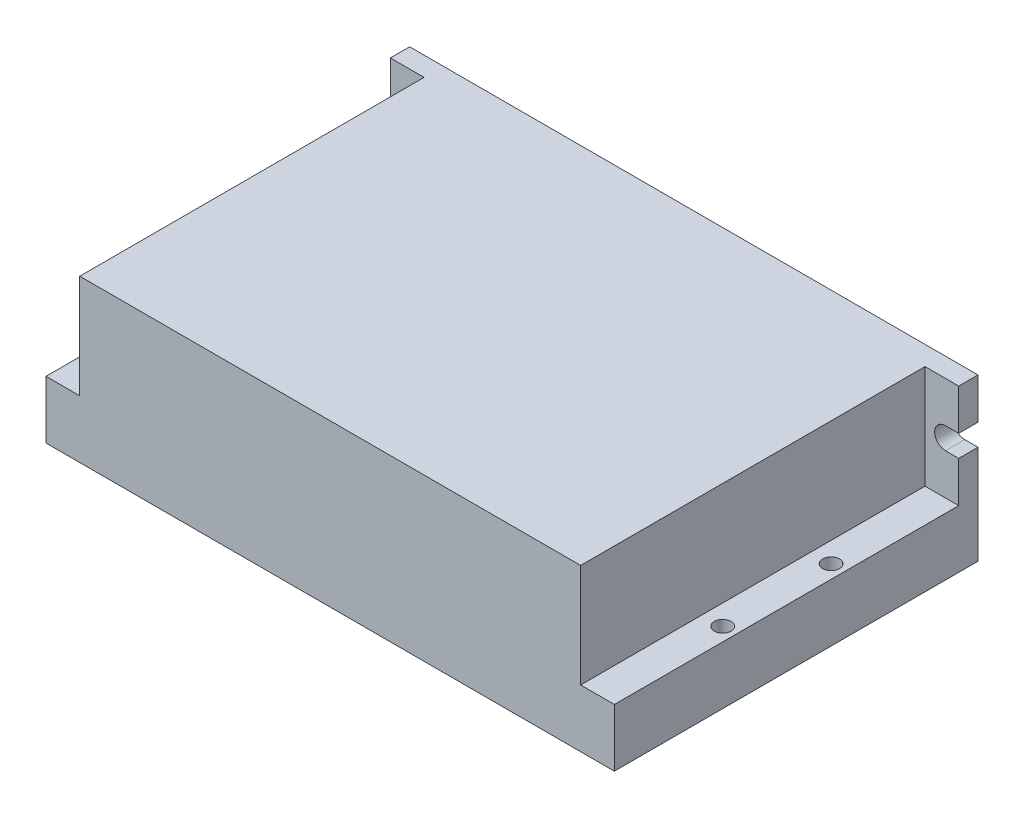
ISO-10303-21;
HEADER;
FILE_DESCRIPTION(('STEP AP214'),'2;1');
FILE_NAME('part.step','',(''),(''),'','','');
FILE_SCHEMA(('AUTOMOTIVE_DESIGN { 1 0 10303 214 1 1 1 1 }'));
ENDSEC;
DATA;
#1=APPLICATION_CONTEXT('core data for automotive mechanical design processes');
#2=APPLICATION_PROTOCOL_DEFINITION('international standard','automotive_design',2000,#1);
#3=PRODUCT_CONTEXT('',#1,'mechanical');
#4=PRODUCT('Part','Part','',(#3));
#5=PRODUCT_RELATED_PRODUCT_CATEGORY('part','',(#4));
#6=PRODUCT_DEFINITION_FORMATION('','',#4);
#7=PRODUCT_DEFINITION_CONTEXT('part definition',#1,'design');
#8=PRODUCT_DEFINITION('design','',#6,#7);
#9=PRODUCT_DEFINITION_SHAPE('','',#8);
#10=(LENGTH_UNIT() NAMED_UNIT(*) SI_UNIT(.MILLI.,.METRE.));
#11=(NAMED_UNIT(*) PLANE_ANGLE_UNIT() SI_UNIT($,.RADIAN.));
#12=(NAMED_UNIT(*) SI_UNIT($,.STERADIAN.) SOLID_ANGLE_UNIT());
#13=UNCERTAINTY_MEASURE_WITH_UNIT(LENGTH_MEASURE(1.E-05),#10,'distance_accuracy_value','');
#14=(GEOMETRIC_REPRESENTATION_CONTEXT(3) GLOBAL_UNCERTAINTY_ASSIGNED_CONTEXT((#13)) GLOBAL_UNIT_ASSIGNED_CONTEXT((#10,
#11,#12)) REPRESENTATION_CONTEXT('',''));
#15=CARTESIAN_POINT('',(0.,0.,0.));
#16=DIRECTION('',(0.,0.,1.));
#17=DIRECTION('',(1.,0.,0.));
#18=AXIS2_PLACEMENT_3D('',#15,#16,#17);
#19=CARTESIAN_POINT('',(0.,33.5,0.));
#20=DIRECTION('',(1.,0.,0.));
#21=DIRECTION('',(0.,0.,-1.));
#22=AXIS2_PLACEMENT_3D('',#19,#20,#21);
#23=PLANE('',#22);
#24=DIRECTION('',(0.,-1.,0.));
#25=VECTOR('',#24,1.);
#26=CARTESIAN_POINT('',(0.,33.5,-75.5));
#27=LINE('',#26,#25);
#28=CARTESIAN_POINT('',(0.,33.5,-75.5));
#29=VERTEX_POINT('',#28);
#30=CARTESIAN_POINT('',(0.,25.,-75.5));
#31=VERTEX_POINT('',#30);
#32=EDGE_CURVE('E182',#29,#31,#27,.T.);
#33=ORIENTED_EDGE('',*,*,#32,.T.);
#34=DIRECTION('',(0.,0.,1.));
#35=VECTOR('',#34,1.);
#36=CARTESIAN_POINT('',(0.,25.,-75.5));
#37=LINE('',#36,#35);
#38=CARTESIAN_POINT('',(0.,25.,-71.5));
#39=VERTEX_POINT('',#38);
#40=EDGE_CURVE('E287',#31,#39,#37,.T.);
#41=ORIENTED_EDGE('',*,*,#40,.T.);
#42=DIRECTION('',(0.,-1.,0.));
#43=VECTOR('',#42,1.);
#44=CARTESIAN_POINT('',(0.,33.5,-71.5));
#45=LINE('',#44,#43);
#46=CARTESIAN_POINT('',(0.,33.5,-71.5));
#47=VERTEX_POINT('',#46);
#48=EDGE_CURVE('E244',#47,#39,#45,.T.);
#49=ORIENTED_EDGE('',*,*,#48,.F.);
#50=DIRECTION('',(0.,0.,1.));
#51=VECTOR('',#50,1.);
#52=CARTESIAN_POINT('',(0.,33.5,0.));
#53=LINE('',#52,#51);
#54=EDGE_CURVE('E216',#29,#47,#53,.T.);
#55=ORIENTED_EDGE('',*,*,#54,.F.);
#56=EDGE_LOOP('',(#33,#41,#49,#55));
#57=FACE_BOUND('',#56,.T.);
#58=ADVANCED_FACE('F35',(#57),#23,.F.);
#59=CARTESIAN_POINT('',(118.,33.5,0.));
#60=DIRECTION('',(-1.,0.,0.));
#61=DIRECTION('',(0.,0.,1.));
#62=AXIS2_PLACEMENT_3D('',#59,#60,#61);
#63=PLANE('',#62);
#64=DIRECTION('',(0.,-1.,0.));
#65=VECTOR('',#64,1.);
#66=CARTESIAN_POINT('',(118.,33.5,-75.5));
#67=LINE('',#66,#65);
#68=CARTESIAN_POINT('',(118.,20.5,-75.5));
#69=VERTEX_POINT('',#68);
#70=CARTESIAN_POINT('',(118.,0.,-75.5));
#71=VERTEX_POINT('',#70);
#72=EDGE_CURVE('E186',#69,#71,#67,.T.);
#73=ORIENTED_EDGE('',*,*,#72,.F.);
#74=DIRECTION('',(0.,0.,1.));
#75=VECTOR('',#74,1.);
#76=CARTESIAN_POINT('',(118.,20.5,-75.5));
#77=LINE('',#76,#75);
#78=CARTESIAN_POINT('',(118.,20.5,-71.5));
#79=VERTEX_POINT('',#78);
#80=EDGE_CURVE('E259',#69,#79,#77,.T.);
#81=ORIENTED_EDGE('',*,*,#80,.T.);
#82=DIRECTION('',(0.,1.,0.));
#83=VECTOR('',#82,1.);
#84=CARTESIAN_POINT('',(118.,33.5,-71.5));
#85=LINE('',#84,#83);
#86=CARTESIAN_POINT('',(118.,12.,-71.5));
#87=VERTEX_POINT('',#86);
#88=EDGE_CURVE('E268',#87,#79,#85,.T.);
#89=ORIENTED_EDGE('',*,*,#88,.F.);
#90=DIRECTION('',(0.,0.,1.));
#91=VECTOR('',#90,1.);
#92=CARTESIAN_POINT('',(118.,12.,-71.5));
#93=LINE('',#92,#91);
#94=CARTESIAN_POINT('',(118.,12.,0.));
#95=VERTEX_POINT('',#94);
#96=EDGE_CURVE('E204',#87,#95,#93,.T.);
#97=ORIENTED_EDGE('',*,*,#96,.T.);
#98=DIRECTION('',(0.,-1.,0.));
#99=VECTOR('',#98,1.);
#100=CARTESIAN_POINT('',(118.,33.5,0.));
#101=LINE('',#100,#99);
#102=CARTESIAN_POINT('',(118.,0.,0.));
#103=VERTEX_POINT('',#102);
#104=EDGE_CURVE('E43',#95,#103,#101,.T.);
#105=ORIENTED_EDGE('',*,*,#104,.T.);
#106=DIRECTION('',(0.,0.,-1.));
#107=VECTOR('',#106,1.);
#108=CARTESIAN_POINT('',(118.,0.,0.));
#109=LINE('',#108,#107);
#110=EDGE_CURVE('E202',#103,#71,#109,.T.);
#111=ORIENTED_EDGE('',*,*,#110,.T.);
#112=EDGE_LOOP('',(#73,#81,#89,#97,#105,#111));
#113=FACE_BOUND('',#112,.T.);
#114=ADVANCED_FACE('F200',(#113),#63,.F.);
#115=CARTESIAN_POINT('',(0.,20.5,-71.5));
#116=VERTEX_POINT('',#115);
#117=CARTESIAN_POINT('',(0.,12.,-71.5));
#118=VERTEX_POINT('',#117);
#119=EDGE_CURVE('E175',#116,#118,#45,.T.);
#120=ORIENTED_EDGE('',*,*,#119,.F.);
#121=DIRECTION('',(0.,0.,1.));
#122=VECTOR('',#121,1.);
#123=CARTESIAN_POINT('',(0.,20.5,-75.5));
#124=LINE('',#123,#122);
#125=CARTESIAN_POINT('',(0.,20.5,-75.5));
#126=VERTEX_POINT('',#125);
#127=EDGE_CURVE('E50',#126,#116,#124,.T.);
#128=ORIENTED_EDGE('',*,*,#127,.F.);
#129=CARTESIAN_POINT('',(0.,0.,-75.5));
#130=VERTEX_POINT('',#129);
#131=EDGE_CURVE('E172',#126,#130,#27,.T.);
#132=ORIENTED_EDGE('',*,*,#131,.T.);
#133=DIRECTION('',(0.,0.,1.));
#134=VECTOR('',#133,1.);
#135=CARTESIAN_POINT('',(0.,0.,0.));
#136=LINE('',#135,#134);
#137=CARTESIAN_POINT('',(0.,0.,0.));
#138=VERTEX_POINT('',#137);
#139=EDGE_CURVE('E213',#130,#138,#136,.T.);
#140=ORIENTED_EDGE('',*,*,#139,.T.);
#141=DIRECTION('',(0.,-1.,0.));
#142=VECTOR('',#141,1.);
#143=CARTESIAN_POINT('',(0.,33.5,0.));
#144=LINE('',#143,#142);
#145=CARTESIAN_POINT('',(0.,12.,0.));
#146=VERTEX_POINT('',#145);
#147=EDGE_CURVE('E11',#146,#138,#144,.T.);
#148=ORIENTED_EDGE('',*,*,#147,.F.);
#149=DIRECTION('',(0.,0.,1.));
#150=VECTOR('',#149,1.);
#151=CARTESIAN_POINT('',(0.,12.,-71.5));
#152=LINE('',#151,#150);
#153=EDGE_CURVE('E226',#118,#146,#152,.T.);
#154=ORIENTED_EDGE('',*,*,#153,.F.);
#155=EDGE_LOOP('',(#120,#128,#132,#140,#148,#154));
#156=FACE_BOUND('',#155,.T.);
#157=ADVANCED_FACE('F37',(#156),#23,.F.);
#158=CARTESIAN_POINT('',(0.,33.5,0.));
#159=DIRECTION('',(0.,0.,-1.));
#160=DIRECTION('',(-1.,0.,0.));
#161=AXIS2_PLACEMENT_3D('',#158,#159,#160);
#162=PLANE('',#161);
#163=ORIENTED_EDGE('',*,*,#104,.F.);
#164=DIRECTION('',(1.,0.,0.));
#165=VECTOR('',#164,1.);
#166=CARTESIAN_POINT('',(118.,12.,0.));
#167=LINE('',#166,#165);
#168=CARTESIAN_POINT('',(111.,12.,0.));
#169=VERTEX_POINT('',#168);
#170=EDGE_CURVE('E253',#169,#95,#167,.T.);
#171=ORIENTED_EDGE('',*,*,#170,.F.);
#172=DIRECTION('',(0.,-1.,0.));
#173=VECTOR('',#172,1.);
#174=CARTESIAN_POINT('',(111.,33.5,0.));
#175=LINE('',#174,#173);
#176=CARTESIAN_POINT('',(111.,33.5,0.));
#177=VERTEX_POINT('',#176);
#178=EDGE_CURVE('E256',#177,#169,#175,.T.);
#179=ORIENTED_EDGE('',*,*,#178,.F.);
#180=DIRECTION('',(1.,0.,0.));
#181=VECTOR('',#180,1.);
#182=CARTESIAN_POINT('',(0.,33.5,0.));
#183=LINE('',#182,#181);
#184=CARTESIAN_POINT('',(7.,33.5,0.));
#185=VERTEX_POINT('',#184);
#186=EDGE_CURVE('E221',#185,#177,#183,.T.);
#187=ORIENTED_EDGE('',*,*,#186,.F.);
#188=DIRECTION('',(0.,1.,0.));
#189=VECTOR('',#188,1.);
#190=CARTESIAN_POINT('',(7.,33.5,0.));
#191=LINE('',#190,#189);
#192=CARTESIAN_POINT('',(7.,12.,0.));
#193=VERTEX_POINT('',#192);
#194=EDGE_CURVE('E233',#193,#185,#191,.T.);
#195=ORIENTED_EDGE('',*,*,#194,.F.);
#196=DIRECTION('',(1.,0.,0.));
#197=VECTOR('',#196,1.);
#198=CARTESIAN_POINT('',(0.,12.,0.));
#199=LINE('',#198,#197);
#200=EDGE_CURVE('E235',#146,#193,#199,.T.);
#201=ORIENTED_EDGE('',*,*,#200,.F.);
#202=ORIENTED_EDGE('',*,*,#147,.T.);
#203=DIRECTION('',(1.,0.,0.));
#204=VECTOR('',#203,1.);
#205=CARTESIAN_POINT('',(0.,0.,0.));
#206=LINE('',#205,#204);
#207=EDGE_CURVE('E208',#138,#103,#206,.T.);
#208=ORIENTED_EDGE('',*,*,#207,.T.);
#209=EDGE_LOOP('',(#163,#171,#179,#187,#195,#201,#202,#208));
#210=FACE_BOUND('',#209,.T.);
#211=ADVANCED_FACE('F209',(#210),#162,.F.);
#212=CARTESIAN_POINT('',(118.,25.,-71.5));
#213=VERTEX_POINT('',#212);
#214=CARTESIAN_POINT('',(118.,33.5,-71.5));
#215=VERTEX_POINT('',#214);
#216=EDGE_CURVE('E255',#213,#215,#85,.T.);
#217=ORIENTED_EDGE('',*,*,#216,.F.);
#218=DIRECTION('',(0.,0.,1.));
#219=VECTOR('',#218,1.);
#220=CARTESIAN_POINT('',(118.,25.,-75.5));
#221=LINE('',#220,#219);
#222=CARTESIAN_POINT('',(118.,25.,-75.5));
#223=VERTEX_POINT('',#222);
#224=EDGE_CURVE('E58',#223,#213,#221,.T.);
#225=ORIENTED_EDGE('',*,*,#224,.F.);
#226=CARTESIAN_POINT('',(118.,33.5,-75.5));
#227=VERTEX_POINT('',#226);
#228=EDGE_CURVE('E192',#227,#223,#67,.T.);
#229=ORIENTED_EDGE('',*,*,#228,.F.);
#230=DIRECTION('',(0.,0.,-1.));
#231=VECTOR('',#230,1.);
#232=CARTESIAN_POINT('',(118.,33.5,0.));
#233=LINE('',#232,#231);
#234=EDGE_CURVE('E187',#215,#227,#233,.T.);
#235=ORIENTED_EDGE('',*,*,#234,.F.);
#236=EDGE_LOOP('',(#217,#225,#229,#235));
#237=FACE_BOUND('',#236,.T.);
#238=ADVANCED_FACE('F390',(#237),#63,.F.);
#239=CARTESIAN_POINT('',(0.,33.5,-75.5));
#240=DIRECTION('',(0.,0.,1.));
#241=DIRECTION('',(1.,0.,0.));
#242=AXIS2_PLACEMENT_3D('',#239,#240,#241);
#243=PLANE('',#242);
#244=CARTESIAN_POINT('',(2.75,22.75,-75.5));
#245=DIRECTION('',(0.,0.,1.));
#246=DIRECTION('',(-1.,0.,0.));
#247=AXIS2_PLACEMENT_3D('',#244,#245,#246);
#248=CIRCLE('',#247,2.25);
#249=CARTESIAN_POINT('',(2.75,20.5,-75.5));
#250=VERTEX_POINT('',#249);
#251=CARTESIAN_POINT('',(2.75,25.,-75.5));
#252=VERTEX_POINT('',#251);
#253=EDGE_CURVE('E166',#250,#252,#248,.T.);
#254=ORIENTED_EDGE('',*,*,#253,.T.);
#255=DIRECTION('',(-1.,0.,0.));
#256=VECTOR('',#255,1.);
#257=CARTESIAN_POINT('',(2.75,25.,-75.5));
#258=LINE('',#257,#256);
#259=EDGE_CURVE('E176',#252,#31,#258,.T.);
#260=ORIENTED_EDGE('',*,*,#259,.T.);
#261=ORIENTED_EDGE('',*,*,#32,.F.);
#262=DIRECTION('',(-1.,0.,0.));
#263=VECTOR('',#262,1.);
#264=CARTESIAN_POINT('',(0.,33.5,-75.5));
#265=LINE('',#264,#263);
#266=EDGE_CURVE('E183',#227,#29,#265,.T.);
#267=ORIENTED_EDGE('',*,*,#266,.F.);
#268=ORIENTED_EDGE('',*,*,#228,.T.);
#269=DIRECTION('',(-1.,0.,0.));
#270=VECTOR('',#269,1.);
#271=CARTESIAN_POINT('',(115.25,25.,-75.5));
#272=LINE('',#271,#270);
#273=CARTESIAN_POINT('',(115.25,25.,-75.5));
#274=VERTEX_POINT('',#273);
#275=EDGE_CURVE('E281',#223,#274,#272,.T.);
#276=ORIENTED_EDGE('',*,*,#275,.T.);
#277=CARTESIAN_POINT('',(115.25,22.75,-75.5));
#278=DIRECTION('',(0.,0.,1.));
#279=DIRECTION('',(1.,0.,0.));
#280=AXIS2_PLACEMENT_3D('',#277,#278,#279);
#281=CIRCLE('',#280,2.25);
#282=CARTESIAN_POINT('',(115.25,20.5,-75.5));
#283=VERTEX_POINT('',#282);
#284=EDGE_CURVE('E290',#274,#283,#281,.T.);
#285=ORIENTED_EDGE('',*,*,#284,.T.);
#286=DIRECTION('',(1.,0.,0.));
#287=VECTOR('',#286,1.);
#288=CARTESIAN_POINT('',(118.,20.5,-75.5));
#289=LINE('',#288,#287);
#290=EDGE_CURVE('E273',#283,#69,#289,.T.);
#291=ORIENTED_EDGE('',*,*,#290,.T.);
#292=ORIENTED_EDGE('',*,*,#72,.T.);
#293=DIRECTION('',(-1.,0.,0.));
#294=VECTOR('',#293,1.);
#295=CARTESIAN_POINT('',(0.,0.,-75.5));
#296=LINE('',#295,#294);
#297=EDGE_CURVE('E180',#71,#130,#296,.T.);
#298=ORIENTED_EDGE('',*,*,#297,.T.);
#299=ORIENTED_EDGE('',*,*,#131,.F.);
#300=DIRECTION('',(1.,0.,0.));
#301=VECTOR('',#300,1.);
#302=CARTESIAN_POINT('',(0.,20.5,-75.5));
#303=LINE('',#302,#301);
#304=EDGE_CURVE('E159',#126,#250,#303,.T.);
#305=ORIENTED_EDGE('',*,*,#304,.T.);
#306=EDGE_LOOP('',(#254,#260,#261,#267,#268,#276,#285,#291,#292,#298,#299,#305));
#307=FACE_BOUND('',#306,.T.);
#308=ADVANCED_FACE('F178',(#307),#243,.F.);
#309=CARTESIAN_POINT('',(0.,33.5,0.));
#310=DIRECTION('',(0.,-1.,0.));
#311=DIRECTION('',(0.,0.,-1.));
#312=AXIS2_PLACEMENT_3D('',#309,#310,#311);
#313=PLANE('',#312);
#314=ORIENTED_EDGE('',*,*,#186,.T.);
#315=DIRECTION('',(0.,0.,1.));
#316=VECTOR('',#315,1.);
#317=CARTESIAN_POINT('',(111.,33.5,-71.5));
#318=LINE('',#317,#316);
#319=CARTESIAN_POINT('',(111.,33.5,-71.5));
#320=VERTEX_POINT('',#319);
#321=EDGE_CURVE('E247',#320,#177,#318,.T.);
#322=ORIENTED_EDGE('',*,*,#321,.F.);
#323=DIRECTION('',(-1.,0.,0.));
#324=VECTOR('',#323,1.);
#325=CARTESIAN_POINT('',(118.,33.5,-71.5));
#326=LINE('',#325,#324);
#327=EDGE_CURVE('E265',#215,#320,#326,.T.);
#328=ORIENTED_EDGE('',*,*,#327,.F.);
#329=ORIENTED_EDGE('',*,*,#234,.T.);
#330=ORIENTED_EDGE('',*,*,#266,.T.);
#331=ORIENTED_EDGE('',*,*,#54,.T.);
#332=DIRECTION('',(-1.,0.,0.));
#333=VECTOR('',#332,1.);
#334=CARTESIAN_POINT('',(0.,33.5,-71.5));
#335=LINE('',#334,#333);
#336=CARTESIAN_POINT('',(7.,33.5,-71.5));
#337=VERTEX_POINT('',#336);
#338=EDGE_CURVE('E229',#337,#47,#335,.T.);
#339=ORIENTED_EDGE('',*,*,#338,.F.);
#340=DIRECTION('',(0.,0.,1.));
#341=VECTOR('',#340,1.);
#342=CARTESIAN_POINT('',(7.,33.5,-71.5));
#343=LINE('',#342,#341);
#344=EDGE_CURVE('E218',#337,#185,#343,.T.);
#345=ORIENTED_EDGE('',*,*,#344,.T.);
#346=EDGE_LOOP('',(#314,#322,#328,#329,#330,#331,#339,#345));
#347=FACE_BOUND('',#346,.T.);
#348=ADVANCED_FACE('F360',(#347),#313,.F.);
#349=CARTESIAN_POINT('',(0.,0.,0.));
#350=DIRECTION('',(0.,-1.,0.));
#351=DIRECTION('',(0.,0.,-1.));
#352=AXIS2_PLACEMENT_3D('',#349,#350,#351);
#353=PLANE('',#352);
#354=CARTESIAN_POINT('',(2.8,0.,-47.8));
#355=DIRECTION('',(0.,1.,0.));
#356=DIRECTION('',(0.,0.,1.));
#357=AXIS2_PLACEMENT_3D('',#354,#355,#356);
#358=CIRCLE('',#357,1.75);
#359=CARTESIAN_POINT('',(2.8,0.,-46.05));
#360=VERTEX_POINT('',#359);
#361=EDGE_CURVE('E325',#360,#360,#358,.T.);
#362=ORIENTED_EDGE('',*,*,#361,.T.);
#363=EDGE_LOOP('',(#362));
#364=FACE_BOUND('',#363,.T.);
#365=CARTESIAN_POINT('',(2.8,0.,-25.3));
#366=DIRECTION('',(0.,1.,0.));
#367=DIRECTION('',(0.,0.,1.));
#368=AXIS2_PLACEMENT_3D('',#365,#366,#367);
#369=CIRCLE('',#368,1.75);
#370=CARTESIAN_POINT('',(2.8,0.,-23.55));
#371=VERTEX_POINT('',#370);
#372=EDGE_CURVE('E319',#371,#371,#369,.T.);
#373=ORIENTED_EDGE('',*,*,#372,.T.);
#374=EDGE_LOOP('',(#373));
#375=FACE_BOUND('',#374,.T.);
#376=CARTESIAN_POINT('',(115.2,0.,-25.3));
#377=DIRECTION('',(0.,1.,0.));
#378=DIRECTION('',(0.,0.,1.));
#379=AXIS2_PLACEMENT_3D('',#376,#377,#378);
#380=CIRCLE('',#379,1.75);
#381=CARTESIAN_POINT('',(115.2,0.,-23.55));
#382=VERTEX_POINT('',#381);
#383=EDGE_CURVE('E313',#382,#382,#380,.T.);
#384=ORIENTED_EDGE('',*,*,#383,.T.);
#385=EDGE_LOOP('',(#384));
#386=FACE_BOUND('',#385,.T.);
#387=CARTESIAN_POINT('',(115.2,0.,-47.8));
#388=DIRECTION('',(0.,1.,0.));
#389=DIRECTION('',(0.,0.,1.));
#390=AXIS2_PLACEMENT_3D('',#387,#388,#389);
#391=CIRCLE('',#390,1.75);
#392=CARTESIAN_POINT('',(115.2,0.,-46.05));
#393=VERTEX_POINT('',#392);
#394=EDGE_CURVE('E306',#393,#393,#391,.T.);
#395=ORIENTED_EDGE('',*,*,#394,.T.);
#396=EDGE_LOOP('',(#395));
#397=FACE_BOUND('',#396,.T.);
#398=ORIENTED_EDGE('',*,*,#139,.F.);
#399=ORIENTED_EDGE('',*,*,#297,.F.);
#400=ORIENTED_EDGE('',*,*,#110,.F.);
#401=ORIENTED_EDGE('',*,*,#207,.F.);
#402=EDGE_LOOP('',(#398,#399,#400,#401));
#403=FACE_BOUND('',#402,.T.);
#404=ADVANCED_FACE('F215',(#364,#375,#386,#397,#403),#353,.T.);
#405=CARTESIAN_POINT('',(7.,33.5,-71.5));
#406=DIRECTION('',(1.,0.,0.));
#407=DIRECTION('',(0.,0.,-1.));
#408=AXIS2_PLACEMENT_3D('',#405,#406,#407);
#409=PLANE('',#408);
#410=ORIENTED_EDGE('',*,*,#194,.T.);
#411=ORIENTED_EDGE('',*,*,#344,.F.);
#412=DIRECTION('',(0.,1.,0.));
#413=VECTOR('',#412,1.);
#414=CARTESIAN_POINT('',(7.,33.5,-71.5));
#415=LINE('',#414,#413);
#416=CARTESIAN_POINT('',(7.,12.,-71.5));
#417=VERTEX_POINT('',#416);
#418=EDGE_CURVE('E239',#417,#337,#415,.T.);
#419=ORIENTED_EDGE('',*,*,#418,.F.);
#420=DIRECTION('',(0.,0.,1.));
#421=VECTOR('',#420,1.);
#422=CARTESIAN_POINT('',(7.,12.,-71.5));
#423=LINE('',#422,#421);
#424=EDGE_CURVE('E228',#417,#193,#423,.T.);
#425=ORIENTED_EDGE('',*,*,#424,.T.);
#426=EDGE_LOOP('',(#410,#411,#419,#425));
#427=FACE_BOUND('',#426,.T.);
#428=ADVANCED_FACE('F347',(#427),#409,.F.);
#429=CARTESIAN_POINT('',(0.,12.,-71.5));
#430=DIRECTION('',(0.,-1.,0.));
#431=DIRECTION('',(0.,0.,-1.));
#432=AXIS2_PLACEMENT_3D('',#429,#430,#431);
#433=PLANE('',#432);
#434=CARTESIAN_POINT('',(2.8,12.,-47.8));
#435=DIRECTION('',(0.,1.,0.));
#436=DIRECTION('',(0.,0.,1.));
#437=AXIS2_PLACEMENT_3D('',#434,#435,#436);
#438=CIRCLE('',#437,1.75);
#439=CARTESIAN_POINT('',(2.8,12.,-46.05));
#440=VERTEX_POINT('',#439);
#441=EDGE_CURVE('E328',#440,#440,#438,.T.);
#442=ORIENTED_EDGE('',*,*,#441,.F.);
#443=EDGE_LOOP('',(#442));
#444=FACE_BOUND('',#443,.T.);
#445=CARTESIAN_POINT('',(2.8,12.,-25.3));
#446=DIRECTION('',(0.,1.,0.));
#447=DIRECTION('',(0.,0.,1.));
#448=AXIS2_PLACEMENT_3D('',#445,#446,#447);
#449=CIRCLE('',#448,1.75);
#450=CARTESIAN_POINT('',(2.8,12.,-23.55));
#451=VERTEX_POINT('',#450);
#452=EDGE_CURVE('E322',#451,#451,#449,.T.);
#453=ORIENTED_EDGE('',*,*,#452,.F.);
#454=EDGE_LOOP('',(#453));
#455=FACE_BOUND('',#454,.T.);
#456=ORIENTED_EDGE('',*,*,#200,.T.);
#457=ORIENTED_EDGE('',*,*,#424,.F.);
#458=DIRECTION('',(1.,0.,0.));
#459=VECTOR('',#458,1.);
#460=CARTESIAN_POINT('',(0.,12.,-71.5));
#461=LINE('',#460,#459);
#462=EDGE_CURVE('E241',#118,#417,#461,.T.);
#463=ORIENTED_EDGE('',*,*,#462,.F.);
#464=ORIENTED_EDGE('',*,*,#153,.T.);
#465=EDGE_LOOP('',(#456,#457,#463,#464));
#466=FACE_BOUND('',#465,.T.);
#467=ADVANCED_FACE('F343',(#444,#455,#466),#433,.F.);
#468=CARTESIAN_POINT('',(0.,0.,-71.5));
#469=DIRECTION('',(0.,0.,1.));
#470=DIRECTION('',(1.,0.,0.));
#471=AXIS2_PLACEMENT_3D('',#468,#469,#470);
#472=PLANE('',#471);
#473=DIRECTION('',(-1.,0.,0.));
#474=VECTOR('',#473,1.);
#475=CARTESIAN_POINT('',(2.75,25.,-71.5));
#476=LINE('',#475,#474);
#477=CARTESIAN_POINT('',(2.75,25.,-71.5));
#478=VERTEX_POINT('',#477);
#479=EDGE_CURVE('E167',#478,#39,#476,.T.);
#480=ORIENTED_EDGE('',*,*,#479,.F.);
#481=CARTESIAN_POINT('',(2.75,22.75,-71.5));
#482=DIRECTION('',(0.,0.,1.));
#483=DIRECTION('',(-1.,0.,0.));
#484=AXIS2_PLACEMENT_3D('',#481,#482,#483);
#485=CIRCLE('',#484,2.25);
#486=CARTESIAN_POINT('',(2.75,20.5,-71.5));
#487=VERTEX_POINT('',#486);
#488=EDGE_CURVE('E301',#487,#478,#485,.T.);
#489=ORIENTED_EDGE('',*,*,#488,.F.);
#490=DIRECTION('',(1.,0.,0.));
#491=VECTOR('',#490,1.);
#492=CARTESIAN_POINT('',(0.,20.5,-71.5));
#493=LINE('',#492,#491);
#494=EDGE_CURVE('E304',#116,#487,#493,.T.);
#495=ORIENTED_EDGE('',*,*,#494,.F.);
#496=ORIENTED_EDGE('',*,*,#119,.T.);
#497=ORIENTED_EDGE('',*,*,#462,.T.);
#498=ORIENTED_EDGE('',*,*,#418,.T.);
#499=ORIENTED_EDGE('',*,*,#338,.T.);
#500=ORIENTED_EDGE('',*,*,#48,.T.);
#501=EDGE_LOOP('',(#480,#489,#495,#496,#497,#498,#499,#500));
#502=FACE_BOUND('',#501,.T.);
#503=ADVANCED_FACE('F346',(#502),#472,.T.);
#504=CARTESIAN_POINT('',(118.,12.,-71.5));
#505=DIRECTION('',(0.,-1.,0.));
#506=DIRECTION('',(0.,0.,-1.));
#507=AXIS2_PLACEMENT_3D('',#504,#505,#506);
#508=PLANE('',#507);
#509=CARTESIAN_POINT('',(115.2,12.,-25.3));
#510=DIRECTION('',(0.,1.,0.));
#511=DIRECTION('',(0.,0.,1.));
#512=AXIS2_PLACEMENT_3D('',#509,#510,#511);
#513=CIRCLE('',#512,1.75);
#514=CARTESIAN_POINT('',(115.2,12.,-23.55));
#515=VERTEX_POINT('',#514);
#516=EDGE_CURVE('E316',#515,#515,#513,.T.);
#517=ORIENTED_EDGE('',*,*,#516,.F.);
#518=EDGE_LOOP('',(#517));
#519=FACE_BOUND('',#518,.T.);
#520=CARTESIAN_POINT('',(115.2,12.,-47.8));
#521=DIRECTION('',(0.,1.,0.));
#522=DIRECTION('',(0.,0.,1.));
#523=AXIS2_PLACEMENT_3D('',#520,#521,#522);
#524=CIRCLE('',#523,1.75);
#525=CARTESIAN_POINT('',(115.2,12.,-46.05));
#526=VERTEX_POINT('',#525);
#527=EDGE_CURVE('E310',#526,#526,#524,.T.);
#528=ORIENTED_EDGE('',*,*,#527,.F.);
#529=EDGE_LOOP('',(#528));
#530=FACE_BOUND('',#529,.T.);
#531=ORIENTED_EDGE('',*,*,#170,.T.);
#532=ORIENTED_EDGE('',*,*,#96,.F.);
#533=DIRECTION('',(1.,0.,0.));
#534=VECTOR('',#533,1.);
#535=CARTESIAN_POINT('',(118.,12.,-71.5));
#536=LINE('',#535,#534);
#537=CARTESIAN_POINT('',(111.,12.,-71.5));
#538=VERTEX_POINT('',#537);
#539=EDGE_CURVE('E250',#538,#87,#536,.T.);
#540=ORIENTED_EDGE('',*,*,#539,.F.);
#541=DIRECTION('',(0.,0.,1.));
#542=VECTOR('',#541,1.);
#543=CARTESIAN_POINT('',(111.,12.,-71.5));
#544=LINE('',#543,#542);
#545=EDGE_CURVE('E249',#538,#169,#544,.T.);
#546=ORIENTED_EDGE('',*,*,#545,.T.);
#547=EDGE_LOOP('',(#531,#532,#540,#546));
#548=FACE_BOUND('',#547,.T.);
#549=ADVANCED_FACE('F410',(#519,#530,#548),#508,.F.);
#550=CARTESIAN_POINT('',(111.,33.5,-71.5));
#551=DIRECTION('',(-1.,0.,0.));
#552=DIRECTION('',(0.,0.,1.));
#553=AXIS2_PLACEMENT_3D('',#550,#551,#552);
#554=PLANE('',#553);
#555=ORIENTED_EDGE('',*,*,#178,.T.);
#556=ORIENTED_EDGE('',*,*,#545,.F.);
#557=DIRECTION('',(0.,-1.,0.));
#558=VECTOR('',#557,1.);
#559=CARTESIAN_POINT('',(111.,33.5,-71.5));
#560=LINE('',#559,#558);
#561=EDGE_CURVE('E262',#320,#538,#560,.T.);
#562=ORIENTED_EDGE('',*,*,#561,.F.);
#563=ORIENTED_EDGE('',*,*,#321,.T.);
#564=EDGE_LOOP('',(#555,#556,#562,#563));
#565=FACE_BOUND('',#564,.T.);
#566=ADVANCED_FACE('F411',(#565),#554,.F.);
#567=CARTESIAN_POINT('',(0.,0.,-71.5));
#568=DIRECTION('',(0.,0.,-1.));
#569=DIRECTION('',(-1.,0.,0.));
#570=AXIS2_PLACEMENT_3D('',#567,#568,#569);
#571=PLANE('',#570);
#572=ORIENTED_EDGE('',*,*,#88,.T.);
#573=DIRECTION('',(1.,0.,0.));
#574=VECTOR('',#573,1.);
#575=CARTESIAN_POINT('',(118.,20.5,-71.5));
#576=LINE('',#575,#574);
#577=CARTESIAN_POINT('',(115.25,20.5,-71.5));
#578=VERTEX_POINT('',#577);
#579=EDGE_CURVE('E279',#578,#79,#576,.T.);
#580=ORIENTED_EDGE('',*,*,#579,.F.);
#581=CARTESIAN_POINT('',(115.25,22.75,-71.5));
#582=DIRECTION('',(0.,0.,1.));
#583=DIRECTION('',(1.,0.,0.));
#584=AXIS2_PLACEMENT_3D('',#581,#582,#583);
#585=CIRCLE('',#584,2.25);
#586=CARTESIAN_POINT('',(115.25,25.,-71.5));
#587=VERTEX_POINT('',#586);
#588=EDGE_CURVE('E282',#587,#578,#585,.T.);
#589=ORIENTED_EDGE('',*,*,#588,.F.);
#590=DIRECTION('',(-1.,0.,0.));
#591=VECTOR('',#590,1.);
#592=CARTESIAN_POINT('',(115.25,25.,-71.5));
#593=LINE('',#592,#591);
#594=EDGE_CURVE('E285',#213,#587,#593,.T.);
#595=ORIENTED_EDGE('',*,*,#594,.F.);
#596=ORIENTED_EDGE('',*,*,#216,.T.);
#597=ORIENTED_EDGE('',*,*,#327,.T.);
#598=ORIENTED_EDGE('',*,*,#561,.T.);
#599=ORIENTED_EDGE('',*,*,#539,.T.);
#600=EDGE_LOOP('',(#572,#580,#589,#595,#596,#597,#598,#599));
#601=FACE_BOUND('',#600,.T.);
#602=ADVANCED_FACE('F414',(#601),#571,.F.);
#603=CARTESIAN_POINT('',(118.,20.5,-75.5));
#604=DIRECTION('',(0.,-1.,0.));
#605=DIRECTION('',(0.,0.,-1.));
#606=AXIS2_PLACEMENT_3D('',#603,#604,#605);
#607=PLANE('',#606);
#608=ORIENTED_EDGE('',*,*,#579,.T.);
#609=ORIENTED_EDGE('',*,*,#80,.F.);
#610=ORIENTED_EDGE('',*,*,#290,.F.);
#611=DIRECTION('',(0.,0.,1.));
#612=VECTOR('',#611,1.);
#613=CARTESIAN_POINT('',(115.25,20.5,-75.5));
#614=LINE('',#613,#612);
#615=EDGE_CURVE('E275',#283,#578,#614,.T.);
#616=ORIENTED_EDGE('',*,*,#615,.T.);
#617=EDGE_LOOP('',(#608,#609,#610,#616));
#618=FACE_BOUND('',#617,.T.);
#619=ADVANCED_FACE('F421',(#618),#607,.F.);
#620=CARTESIAN_POINT('',(115.25,22.75,-75.5));
#621=DIRECTION('',(0.,0.,1.));
#622=DIRECTION('',(1.,0.,0.));
#623=AXIS2_PLACEMENT_3D('',#620,#621,#622);
#624=CYLINDRICAL_SURFACE('',#623,2.25);
#625=ORIENTED_EDGE('',*,*,#588,.T.);
#626=ORIENTED_EDGE('',*,*,#615,.F.);
#627=ORIENTED_EDGE('',*,*,#284,.F.);
#628=DIRECTION('',(0.,0.,1.));
#629=VECTOR('',#628,1.);
#630=CARTESIAN_POINT('',(115.25,25.,-75.5));
#631=LINE('',#630,#629);
#632=EDGE_CURVE('E272',#274,#587,#631,.T.);
#633=ORIENTED_EDGE('',*,*,#632,.T.);
#634=EDGE_LOOP('',(#625,#626,#627,#633));
#635=FACE_BOUND('',#634,.T.);
#636=ADVANCED_FACE('F425',(#635),#624,.F.);
#637=CARTESIAN_POINT('',(115.25,25.,-75.5));
#638=DIRECTION('',(0.,1.,0.));
#639=DIRECTION('',(0.,0.,1.));
#640=AXIS2_PLACEMENT_3D('',#637,#638,#639);
#641=PLANE('',#640);
#642=ORIENTED_EDGE('',*,*,#594,.T.);
#643=ORIENTED_EDGE('',*,*,#632,.F.);
#644=ORIENTED_EDGE('',*,*,#275,.F.);
#645=ORIENTED_EDGE('',*,*,#224,.T.);
#646=EDGE_LOOP('',(#642,#643,#644,#645));
#647=FACE_BOUND('',#646,.T.);
#648=ADVANCED_FACE('F383',(#647),#641,.F.);
#649=CARTESIAN_POINT('',(2.75,25.,-75.5));
#650=DIRECTION('',(0.,1.,0.));
#651=DIRECTION('',(0.,0.,1.));
#652=AXIS2_PLACEMENT_3D('',#649,#650,#651);
#653=PLANE('',#652);
#654=ORIENTED_EDGE('',*,*,#479,.T.);
#655=ORIENTED_EDGE('',*,*,#40,.F.);
#656=ORIENTED_EDGE('',*,*,#259,.F.);
#657=DIRECTION('',(0.,0.,1.));
#658=VECTOR('',#657,1.);
#659=CARTESIAN_POINT('',(2.75,25.,-75.5));
#660=LINE('',#659,#658);
#661=EDGE_CURVE('E296',#252,#478,#660,.T.);
#662=ORIENTED_EDGE('',*,*,#661,.T.);
#663=EDGE_LOOP('',(#654,#655,#656,#662));
#664=FACE_BOUND('',#663,.T.);
#665=ADVANCED_FACE('F370',(#664),#653,.F.);
#666=CARTESIAN_POINT('',(2.75,22.75,-75.5));
#667=DIRECTION('',(0.,0.,1.));
#668=DIRECTION('',(1.,0.,0.));
#669=AXIS2_PLACEMENT_3D('',#666,#667,#668);
#670=CYLINDRICAL_SURFACE('',#669,2.25);
#671=ORIENTED_EDGE('',*,*,#488,.T.);
#672=ORIENTED_EDGE('',*,*,#661,.F.);
#673=ORIENTED_EDGE('',*,*,#253,.F.);
#674=DIRECTION('',(0.,0.,1.));
#675=VECTOR('',#674,1.);
#676=CARTESIAN_POINT('',(2.75,20.5,-75.5));
#677=LINE('',#676,#675);
#678=EDGE_CURVE('E161',#250,#487,#677,.T.);
#679=ORIENTED_EDGE('',*,*,#678,.T.);
#680=EDGE_LOOP('',(#671,#672,#673,#679));
#681=FACE_BOUND('',#680,.T.);
#682=ADVANCED_FACE('F373',(#681),#670,.F.);
#683=CARTESIAN_POINT('',(0.,20.5,-75.5));
#684=DIRECTION('',(0.,-1.,0.));
#685=DIRECTION('',(0.,0.,-1.));
#686=AXIS2_PLACEMENT_3D('',#683,#684,#685);
#687=PLANE('',#686);
#688=ORIENTED_EDGE('',*,*,#494,.T.);
#689=ORIENTED_EDGE('',*,*,#678,.F.);
#690=ORIENTED_EDGE('',*,*,#304,.F.);
#691=ORIENTED_EDGE('',*,*,#127,.T.);
#692=EDGE_LOOP('',(#688,#689,#690,#691));
#693=FACE_BOUND('',#692,.T.);
#694=ADVANCED_FACE('F160',(#693),#687,.F.);
#695=CARTESIAN_POINT('',(115.2,0.,-47.8));
#696=DIRECTION('',(0.,1.,0.));
#697=DIRECTION('',(0.,0.,1.));
#698=AXIS2_PLACEMENT_3D('',#695,#696,#697);
#699=CYLINDRICAL_SURFACE('',#698,1.75);
#700=ORIENTED_EDGE('',*,*,#394,.F.);
#701=EDGE_LOOP('',(#700));
#702=FACE_BOUND('',#701,.T.);
#703=ORIENTED_EDGE('',*,*,#527,.T.);
#704=EDGE_LOOP('',(#703));
#705=FACE_BOUND('',#704,.T.);
#706=ADVANCED_FACE('F381',(#702,#705),#699,.F.);
#707=CARTESIAN_POINT('',(115.2,0.,-25.3));
#708=DIRECTION('',(0.,1.,0.));
#709=DIRECTION('',(0.,0.,1.));
#710=AXIS2_PLACEMENT_3D('',#707,#708,#709);
#711=CYLINDRICAL_SURFACE('',#710,1.75);
#712=ORIENTED_EDGE('',*,*,#383,.F.);
#713=EDGE_LOOP('',(#712));
#714=FACE_BOUND('',#713,.T.);
#715=ORIENTED_EDGE('',*,*,#516,.T.);
#716=EDGE_LOOP('',(#715));
#717=FACE_BOUND('',#716,.T.);
#718=ADVANCED_FACE('F498',(#714,#717),#711,.F.);
#719=CARTESIAN_POINT('',(2.8,0.,-25.3));
#720=DIRECTION('',(0.,1.,0.));
#721=DIRECTION('',(0.,0.,1.));
#722=AXIS2_PLACEMENT_3D('',#719,#720,#721);
#723=CYLINDRICAL_SURFACE('',#722,1.75);
#724=ORIENTED_EDGE('',*,*,#372,.F.);
#725=EDGE_LOOP('',(#724));
#726=FACE_BOUND('',#725,.T.);
#727=ORIENTED_EDGE('',*,*,#452,.T.);
#728=EDGE_LOOP('',(#727));
#729=FACE_BOUND('',#728,.T.);
#730=ADVANCED_FACE('F339',(#726,#729),#723,.F.);
#731=CARTESIAN_POINT('',(2.8,0.,-47.8));
#732=DIRECTION('',(0.,1.,0.));
#733=DIRECTION('',(0.,0.,1.));
#734=AXIS2_PLACEMENT_3D('',#731,#732,#733);
#735=CYLINDRICAL_SURFACE('',#734,1.75);
#736=ORIENTED_EDGE('',*,*,#361,.F.);
#737=EDGE_LOOP('',(#736));
#738=FACE_BOUND('',#737,.T.);
#739=ORIENTED_EDGE('',*,*,#441,.T.);
#740=EDGE_LOOP('',(#739));
#741=FACE_BOUND('',#740,.T.);
#742=ADVANCED_FACE('F336',(#738,#741),#735,.F.);
#743=CLOSED_SHELL('',(#58,#114,#157,#211,#238,#308,#348,#404,#428,#467,#503,#549,#566,#602,#619,
#636,#648,#665,#682,#694,#706,#718,#730,#742));
#744=MANIFOLD_SOLID_BREP('B2',#743);
#745=ADVANCED_BREP_SHAPE_REPRESENTATION('',(#18,#744),#14);
#746=SHAPE_DEFINITION_REPRESENTATION(#9,#745);
ENDSEC;
END-ISO-10303-21;
